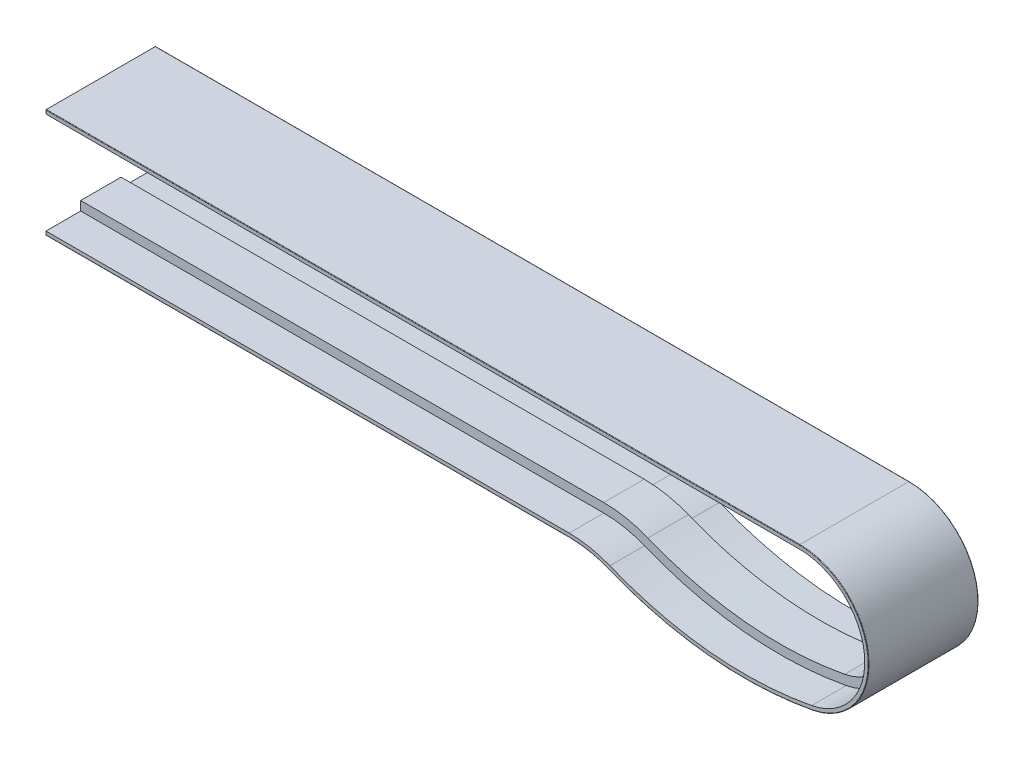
ISO-10303-21;
HEADER;
FILE_DESCRIPTION(('STEP AP214'),'2;1');
FILE_NAME('part.step','',(''),(''),'','','');
FILE_SCHEMA(('AUTOMOTIVE_DESIGN { 1 0 10303 214 1 1 1 1 }'));
ENDSEC;
DATA;
#1=APPLICATION_CONTEXT('core data for automotive mechanical design processes');
#2=APPLICATION_PROTOCOL_DEFINITION('international standard','automotive_design',2000,#1);
#3=PRODUCT_CONTEXT('',#1,'mechanical');
#4=PRODUCT('Part','Part','',(#3));
#5=PRODUCT_RELATED_PRODUCT_CATEGORY('part','',(#4));
#6=PRODUCT_DEFINITION_FORMATION('','',#4);
#7=PRODUCT_DEFINITION_CONTEXT('part definition',#1,'design');
#8=PRODUCT_DEFINITION('design','',#6,#7);
#9=PRODUCT_DEFINITION_SHAPE('','',#8);
#10=(LENGTH_UNIT() NAMED_UNIT(*) SI_UNIT(.MILLI.,.METRE.));
#11=(NAMED_UNIT(*) PLANE_ANGLE_UNIT() SI_UNIT($,.RADIAN.));
#12=(NAMED_UNIT(*) SI_UNIT($,.STERADIAN.) SOLID_ANGLE_UNIT());
#13=UNCERTAINTY_MEASURE_WITH_UNIT(LENGTH_MEASURE(1.E-05),#10,'distance_accuracy_value','');
#14=(GEOMETRIC_REPRESENTATION_CONTEXT(3) GLOBAL_UNCERTAINTY_ASSIGNED_CONTEXT((#13)) GLOBAL_UNIT_ASSIGNED_CONTEXT((#10,
#11,#12)) REPRESENTATION_CONTEXT('',''));
#15=CARTESIAN_POINT('',(0.,0.,0.));
#16=DIRECTION('',(0.,0.,1.));
#17=DIRECTION('',(1.,0.,0.));
#18=AXIS2_PLACEMENT_3D('',#15,#16,#17);
#19=CARTESIAN_POINT('',(545.,-113.,-56.65));
#20=DIRECTION('',(-1.,0.,0.));
#21=DIRECTION('',(0.,-1.,0.));
#22=AXIS2_PLACEMENT_3D('',#19,#20,#21);
#23=CYLINDRICAL_SURFACE('',#22,0.5);
#24=CARTESIAN_POINT('',(545.,-113.,-56.65));
#25=DIRECTION('',(-1.,0.,0.));
#26=DIRECTION('',(0.,0.,-1.));
#27=AXIS2_PLACEMENT_3D('',#24,#25,#26);
#28=CIRCLE('',#27,0.5);
#29=CARTESIAN_POINT('',(545.,-113.,-57.15));
#30=VERTEX_POINT('',#29);
#31=CARTESIAN_POINT('',(545.,-113.5,-56.65));
#32=VERTEX_POINT('',#31);
#33=EDGE_CURVE('E415',#30,#32,#28,.T.);
#34=ORIENTED_EDGE('',*,*,#33,.T.);
#35=DIRECTION('',(-1.,0.,0.));
#36=VECTOR('',#35,1.);
#37=CARTESIAN_POINT('',(545.,-113.5,-56.65));
#38=LINE('',#37,#36);
#39=CARTESIAN_POINT('',(-1.11022302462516E-13,-113.5,-56.65));
#40=VERTEX_POINT('',#39);
#41=EDGE_CURVE('E522',#32,#40,#38,.T.);
#42=ORIENTED_EDGE('',*,*,#41,.T.);
#43=CARTESIAN_POINT('',(0.,-113.,-56.65));
#44=DIRECTION('',(-1.,0.,0.));
#45=DIRECTION('',(0.,0.,-1.));
#46=AXIS2_PLACEMENT_3D('',#43,#44,#45);
#47=CIRCLE('',#46,0.5);
#48=CARTESIAN_POINT('',(0.,-113.,-57.15));
#49=VERTEX_POINT('',#48);
#50=EDGE_CURVE('E64',#49,#40,#47,.T.);
#51=ORIENTED_EDGE('',*,*,#50,.F.);
#52=DIRECTION('',(-1.,0.,0.));
#53=VECTOR('',#52,1.);
#54=CARTESIAN_POINT('',(545.,-113.,-57.15));
#55=LINE('',#54,#53);
#56=EDGE_CURVE('E49',#30,#49,#55,.T.);
#57=ORIENTED_EDGE('',*,*,#56,.F.);
#58=EDGE_LOOP('',(#34,#42,#51,#57));
#59=FACE_BOUND('',#58,.T.);
#60=ADVANCED_FACE('F41',(#59),#23,.T.);
#61=CARTESIAN_POINT('',(545.,-113.5,56.65));
#62=DIRECTION('',(0.,-1.,0.));
#63=DIRECTION('',(1.,0.,0.));
#64=AXIS2_PLACEMENT_3D('',#61,#62,#63);
#65=PLANE('',#64);
#66=DIRECTION('',(0.,0.,1.));
#67=VECTOR('',#66,1.);
#68=CARTESIAN_POINT('',(545.,-113.5,56.65));
#69=LINE('',#68,#67);
#70=CARTESIAN_POINT('',(545.,-113.5,56.65));
#71=VERTEX_POINT('',#70);
#72=EDGE_CURVE('E411',#32,#71,#69,.T.);
#73=ORIENTED_EDGE('',*,*,#72,.T.);
#74=DIRECTION('',(-1.,0.,0.));
#75=VECTOR('',#74,1.);
#76=CARTESIAN_POINT('',(545.,-113.5,56.65));
#77=LINE('',#76,#75);
#78=CARTESIAN_POINT('',(-1.11022302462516E-13,-113.5,56.65));
#79=VERTEX_POINT('',#78);
#80=EDGE_CURVE('E518',#71,#79,#77,.T.);
#81=ORIENTED_EDGE('',*,*,#80,.T.);
#82=DIRECTION('',(0.,0.,1.));
#83=VECTOR('',#82,1.);
#84=CARTESIAN_POINT('',(-1.11022302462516E-13,-113.5,56.65));
#85=LINE('',#84,#83);
#86=EDGE_CURVE('E486',#40,#79,#85,.T.);
#87=ORIENTED_EDGE('',*,*,#86,.F.);
#88=ORIENTED_EDGE('',*,*,#41,.F.);
#89=EDGE_LOOP('',(#73,#81,#87,#88));
#90=FACE_BOUND('',#89,.T.);
#91=ADVANCED_FACE('F537',(#90),#65,.T.);
#92=CARTESIAN_POINT('',(545.,-113.,56.65));
#93=DIRECTION('',(-1.,0.,0.));
#94=DIRECTION('',(0.,-1.,0.));
#95=AXIS2_PLACEMENT_3D('',#92,#93,#94);
#96=CYLINDRICAL_SURFACE('',#95,0.5);
#97=CARTESIAN_POINT('',(545.,-113.,56.65));
#98=DIRECTION('',(-1.,0.,0.));
#99=DIRECTION('',(0.,0.,-1.));
#100=AXIS2_PLACEMENT_3D('',#97,#98,#99);
#101=CIRCLE('',#100,0.5);
#102=CARTESIAN_POINT('',(545.,-113.,57.15));
#103=VERTEX_POINT('',#102);
#104=EDGE_CURVE('E407',#71,#103,#101,.T.);
#105=ORIENTED_EDGE('',*,*,#104,.T.);
#106=DIRECTION('',(-1.,0.,0.));
#107=VECTOR('',#106,1.);
#108=CARTESIAN_POINT('',(545.,-113.,57.15));
#109=LINE('',#108,#107);
#110=CARTESIAN_POINT('',(0.,-113.,57.15));
#111=VERTEX_POINT('',#110);
#112=EDGE_CURVE('E514',#103,#111,#109,.T.);
#113=ORIENTED_EDGE('',*,*,#112,.T.);
#114=CARTESIAN_POINT('',(0.,-113.,56.65));
#115=DIRECTION('',(-1.,0.,0.));
#116=DIRECTION('',(0.,0.,-1.));
#117=AXIS2_PLACEMENT_3D('',#114,#115,#116);
#118=CIRCLE('',#117,0.5);
#119=EDGE_CURVE('E482',#79,#111,#118,.T.);
#120=ORIENTED_EDGE('',*,*,#119,.F.);
#121=ORIENTED_EDGE('',*,*,#80,.F.);
#122=EDGE_LOOP('',(#105,#113,#120,#121));
#123=FACE_BOUND('',#122,.T.);
#124=ADVANCED_FACE('F541',(#123),#96,.T.);
#125=CARTESIAN_POINT('',(545.,-109.5,57.15));
#126=DIRECTION('',(0.,1.,0.));
#127=DIRECTION('',(-1.,0.,0.));
#128=AXIS2_PLACEMENT_3D('',#125,#126,#127);
#129=PLANE('',#128);
#130=DIRECTION('',(0.,0.,-1.));
#131=VECTOR('',#130,1.);
#132=CARTESIAN_POINT('',(545.,-109.5,57.15));
#133=LINE('',#132,#131);
#134=CARTESIAN_POINT('',(545.,-109.5,57.15));
#135=VERTEX_POINT('',#134);
#136=CARTESIAN_POINT('',(545.,-109.5,21.05));
#137=VERTEX_POINT('',#136);
#138=EDGE_CURVE('E403',#135,#137,#133,.T.);
#139=ORIENTED_EDGE('',*,*,#138,.T.);
#140=DIRECTION('',(-1.,0.,0.));
#141=VECTOR('',#140,1.);
#142=CARTESIAN_POINT('',(545.,-109.5,21.05));
#143=LINE('',#142,#141);
#144=CARTESIAN_POINT('',(0.,-109.5,21.05));
#145=VERTEX_POINT('',#144);
#146=EDGE_CURVE('E506',#137,#145,#143,.T.);
#147=ORIENTED_EDGE('',*,*,#146,.T.);
#148=DIRECTION('',(0.,0.,-1.));
#149=VECTOR('',#148,1.);
#150=CARTESIAN_POINT('',(0.,-109.5,57.15));
#151=LINE('',#150,#149);
#152=CARTESIAN_POINT('',(0.,-109.5,57.15));
#153=VERTEX_POINT('',#152);
#154=EDGE_CURVE('E474',#153,#145,#151,.T.);
#155=ORIENTED_EDGE('',*,*,#154,.F.);
#156=DIRECTION('',(-1.,0.,0.));
#157=VECTOR('',#156,1.);
#158=CARTESIAN_POINT('',(545.,-109.5,57.15));
#159=LINE('',#158,#157);
#160=EDGE_CURVE('E510',#135,#153,#159,.T.);
#161=ORIENTED_EDGE('',*,*,#160,.F.);
#162=EDGE_LOOP('',(#139,#147,#155,#161));
#163=FACE_BOUND('',#162,.T.);
#164=ADVANCED_FACE('F664',(#163),#129,.T.);
#165=CARTESIAN_POINT('',(545.,-100.,21.05));
#166=DIRECTION('',(0.,1.,0.));
#167=DIRECTION('',(0.,0.,1.));
#168=AXIS2_PLACEMENT_3D('',#165,#166,#167);
#169=PLANE('',#168);
#170=DIRECTION('',(0.,0.,-1.));
#171=VECTOR('',#170,1.);
#172=CARTESIAN_POINT('',(545.,-100.,21.05));
#173=LINE('',#172,#171);
#174=CARTESIAN_POINT('',(545.,-100.,21.05));
#175=VERTEX_POINT('',#174);
#176=CARTESIAN_POINT('',(545.,-100.,-21.05));
#177=VERTEX_POINT('',#176);
#178=EDGE_CURVE('E399',#175,#177,#173,.T.);
#179=ORIENTED_EDGE('',*,*,#178,.T.);
#180=DIRECTION('',(-1.,0.,0.));
#181=VECTOR('',#180,1.);
#182=CARTESIAN_POINT('',(545.,-100.,-21.05));
#183=LINE('',#182,#181);
#184=CARTESIAN_POINT('',(-1.11022302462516E-13,-100.,-21.05));
#185=VERTEX_POINT('',#184);
#186=EDGE_CURVE('E498',#177,#185,#183,.T.);
#187=ORIENTED_EDGE('',*,*,#186,.T.);
#188=DIRECTION('',(0.,0.,-1.));
#189=VECTOR('',#188,1.);
#190=CARTESIAN_POINT('',(-1.11022302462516E-13,-100.,21.05));
#191=LINE('',#190,#189);
#192=CARTESIAN_POINT('',(-1.11022302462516E-13,-100.,21.05));
#193=VERTEX_POINT('',#192);
#194=EDGE_CURVE('E466',#193,#185,#191,.T.);
#195=ORIENTED_EDGE('',*,*,#194,.F.);
#196=DIRECTION('',(-1.,0.,0.));
#197=VECTOR('',#196,1.);
#198=CARTESIAN_POINT('',(545.,-100.,21.05));
#199=LINE('',#198,#197);
#200=EDGE_CURVE('E502',#175,#193,#199,.T.);
#201=ORIENTED_EDGE('',*,*,#200,.F.);
#202=EDGE_LOOP('',(#179,#187,#195,#201));
#203=FACE_BOUND('',#202,.T.);
#204=ADVANCED_FACE('F669',(#203),#169,.T.);
#205=CARTESIAN_POINT('',(545.,-109.5,-21.05));
#206=DIRECTION('',(0.,1.,0.));
#207=DIRECTION('',(0.,0.,1.));
#208=AXIS2_PLACEMENT_3D('',#205,#206,#207);
#209=PLANE('',#208);
#210=DIRECTION('',(0.,0.,-1.));
#211=VECTOR('',#210,1.);
#212=CARTESIAN_POINT('',(545.,-109.5,-21.05));
#213=LINE('',#212,#211);
#214=CARTESIAN_POINT('',(545.,-109.5,-21.05));
#215=VERTEX_POINT('',#214);
#216=CARTESIAN_POINT('',(545.,-109.5,-57.15));
#217=VERTEX_POINT('',#216);
#218=EDGE_CURVE('E395',#215,#217,#213,.T.);
#219=ORIENTED_EDGE('',*,*,#218,.T.);
#220=DIRECTION('',(-1.,0.,0.));
#221=VECTOR('',#220,1.);
#222=CARTESIAN_POINT('',(545.,-109.5,-57.15));
#223=LINE('',#222,#221);
#224=CARTESIAN_POINT('',(0.,-109.5,-57.15));
#225=VERTEX_POINT('',#224);
#226=EDGE_CURVE('E11',#217,#225,#223,.T.);
#227=ORIENTED_EDGE('',*,*,#226,.T.);
#228=DIRECTION('',(0.,0.,-1.));
#229=VECTOR('',#228,1.);
#230=CARTESIAN_POINT('',(0.,-109.5,-21.05));
#231=LINE('',#230,#229);
#232=CARTESIAN_POINT('',(0.,-109.5,-21.05));
#233=VERTEX_POINT('',#232);
#234=EDGE_CURVE('E459',#233,#225,#231,.T.);
#235=ORIENTED_EDGE('',*,*,#234,.F.);
#236=DIRECTION('',(-1.,0.,0.));
#237=VECTOR('',#236,1.);
#238=CARTESIAN_POINT('',(545.,-109.5,-21.05));
#239=LINE('',#238,#237);
#240=EDGE_CURVE('E494',#215,#233,#239,.T.);
#241=ORIENTED_EDGE('',*,*,#240,.F.);
#242=EDGE_LOOP('',(#219,#227,#235,#241));
#243=FACE_BOUND('',#242,.T.);
#244=ADVANCED_FACE('F545',(#243),#209,.T.);
#245=CARTESIAN_POINT('',(545.,-222.,-56.65));
#246=DIRECTION('',(0.,0.,1.));
#247=DIRECTION('',(1.,0.,0.));
#248=AXIS2_PLACEMENT_3D('',#245,#246,#247);
#249=TOROIDAL_SURFACE('',#248,109.,0.5);
#250=CARTESIAN_POINT('',(586.08854839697,-121.040942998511,-56.65));
#251=DIRECTION('',(-0.926229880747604,0.376959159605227,0.));
#252=DIRECTION('',(0.,0.,-1.));
#253=AXIS2_PLACEMENT_3D('',#250,#251,#252);
#254=CIRCLE('',#253,0.5);
#255=CARTESIAN_POINT('',(586.08854839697,-121.040942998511,-57.15));
#256=VERTEX_POINT('',#255);
#257=CARTESIAN_POINT('',(585.900068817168,-121.504057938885,-56.65));
#258=VERTEX_POINT('',#257);
#259=EDGE_CURVE('E353',#256,#258,#254,.T.);
#260=ORIENTED_EDGE('',*,*,#259,.T.);
#261=CARTESIAN_POINT('',(545.,-222.,-56.65));
#262=DIRECTION('',(0.,0.,1.));
#263=DIRECTION('',(1.,0.,0.));
#264=AXIS2_PLACEMENT_3D('',#261,#262,#263);
#265=CIRCLE('',#264,108.5);
#266=EDGE_CURVE('E447',#258,#32,#265,.T.);
#267=ORIENTED_EDGE('',*,*,#266,.T.);
#268=ORIENTED_EDGE('',*,*,#33,.F.);
#269=CARTESIAN_POINT('',(545.,-222.,-57.15));
#270=DIRECTION('',(0.,0.,1.));
#271=DIRECTION('',(1.,0.,0.));
#272=AXIS2_PLACEMENT_3D('',#269,#270,#271);
#273=CIRCLE('',#272,109.);
#274=EDGE_CURVE('E451',#256,#30,#273,.T.);
#275=ORIENTED_EDGE('',*,*,#274,.F.);
#276=EDGE_LOOP('',(#260,#267,#268,#275));
#277=FACE_BOUND('',#276,.T.);
#278=ADVANCED_FACE('F529',(#277),#249,.T.);
#279=CARTESIAN_POINT('',(545.,-222.,0.));
#280=DIRECTION('',(0.,0.,1.));
#281=DIRECTION('',(1.,0.,0.));
#282=AXIS2_PLACEMENT_3D('',#279,#280,#281);
#283=CYLINDRICAL_SURFACE('',#282,108.5);
#284=DIRECTION('',(0.,0.,1.));
#285=VECTOR('',#284,1.);
#286=CARTESIAN_POINT('',(585.900068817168,-121.504057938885,56.65));
#287=LINE('',#286,#285);
#288=CARTESIAN_POINT('',(585.900068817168,-121.504057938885,56.65));
#289=VERTEX_POINT('',#288);
#290=EDGE_CURVE('E349',#258,#289,#287,.T.);
#291=ORIENTED_EDGE('',*,*,#290,.T.);
#292=CARTESIAN_POINT('',(545.,-222.,56.65));
#293=DIRECTION('',(0.,0.,1.));
#294=DIRECTION('',(1.,0.,0.));
#295=AXIS2_PLACEMENT_3D('',#292,#293,#294);
#296=CIRCLE('',#295,108.5);
#297=EDGE_CURVE('E443',#289,#71,#296,.T.);
#298=ORIENTED_EDGE('',*,*,#297,.T.);
#299=ORIENTED_EDGE('',*,*,#72,.F.);
#300=ORIENTED_EDGE('',*,*,#266,.F.);
#301=EDGE_LOOP('',(#291,#298,#299,#300));
#302=FACE_BOUND('',#301,.T.);
#303=ADVANCED_FACE('F533',(#302),#283,.F.);
#304=CARTESIAN_POINT('',(545.,-222.,56.65));
#305=DIRECTION('',(0.,0.,1.));
#306=DIRECTION('',(1.,0.,0.));
#307=AXIS2_PLACEMENT_3D('',#304,#305,#306);
#308=TOROIDAL_SURFACE('',#307,109.,0.5);
#309=CARTESIAN_POINT('',(586.08854839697,-121.040942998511,56.65));
#310=DIRECTION('',(-0.926229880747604,0.376959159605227,0.));
#311=DIRECTION('',(0.,0.,-1.));
#312=AXIS2_PLACEMENT_3D('',#309,#310,#311);
#313=CIRCLE('',#312,0.5);
#314=CARTESIAN_POINT('',(586.08854839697,-121.040942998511,57.15));
#315=VERTEX_POINT('',#314);
#316=EDGE_CURVE('E345',#289,#315,#313,.T.);
#317=ORIENTED_EDGE('',*,*,#316,.T.);
#318=CARTESIAN_POINT('',(545.,-222.,57.15));
#319=DIRECTION('',(0.,0.,1.));
#320=DIRECTION('',(1.,0.,0.));
#321=AXIS2_PLACEMENT_3D('',#318,#319,#320);
#322=CIRCLE('',#321,109.);
#323=EDGE_CURVE('E439',#315,#103,#322,.T.);
#324=ORIENTED_EDGE('',*,*,#323,.T.);
#325=ORIENTED_EDGE('',*,*,#104,.F.);
#326=ORIENTED_EDGE('',*,*,#297,.F.);
#327=EDGE_LOOP('',(#317,#324,#325,#326));
#328=FACE_BOUND('',#327,.T.);
#329=ADVANCED_FACE('F539',(#328),#308,.T.);
#330=CARTESIAN_POINT('',(545.,-222.,0.));
#331=DIRECTION('',(0.,0.,1.));
#332=DIRECTION('',(1.,0.,0.));
#333=AXIS2_PLACEMENT_3D('',#330,#331,#332);
#334=CYLINDRICAL_SURFACE('',#333,112.5);
#335=DIRECTION('',(0.,0.,-1.));
#336=VECTOR('',#335,1.);
#337=CARTESIAN_POINT('',(587.407905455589,-117.799138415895,57.15));
#338=LINE('',#337,#336);
#339=CARTESIAN_POINT('',(587.407905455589,-117.799138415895,57.15));
#340=VERTEX_POINT('',#339);
#341=CARTESIAN_POINT('',(587.407905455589,-117.799138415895,21.05));
#342=VERTEX_POINT('',#341);
#343=EDGE_CURVE('E341',#340,#342,#338,.T.);
#344=ORIENTED_EDGE('',*,*,#343,.T.);
#345=CARTESIAN_POINT('',(545.,-222.,21.05));
#346=DIRECTION('',(0.,0.,1.));
#347=DIRECTION('',(1.,0.,0.));
#348=AXIS2_PLACEMENT_3D('',#345,#346,#347);
#349=CIRCLE('',#348,112.5);
#350=EDGE_CURVE('E431',#342,#137,#349,.T.);
#351=ORIENTED_EDGE('',*,*,#350,.T.);
#352=ORIENTED_EDGE('',*,*,#138,.F.);
#353=CARTESIAN_POINT('',(545.,-222.,57.15));
#354=DIRECTION('',(0.,0.,1.));
#355=DIRECTION('',(1.,0.,0.));
#356=AXIS2_PLACEMENT_3D('',#353,#354,#355);
#357=CIRCLE('',#356,112.5);
#358=EDGE_CURVE('E435',#340,#135,#357,.T.);
#359=ORIENTED_EDGE('',*,*,#358,.F.);
#360=EDGE_LOOP('',(#344,#351,#352,#359));
#361=FACE_BOUND('',#360,.T.);
#362=ADVANCED_FACE('F682',(#361),#334,.T.);
#363=CARTESIAN_POINT('',(545.,-222.,0.));
#364=DIRECTION('',(0.,0.,1.));
#365=DIRECTION('',(1.,0.,0.));
#366=AXIS2_PLACEMENT_3D('',#363,#364,#365);
#367=CYLINDRICAL_SURFACE('',#366,122.);
#368=DIRECTION('',(0.,0.,-1.));
#369=VECTOR('',#368,1.);
#370=CARTESIAN_POINT('',(590.989017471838,-108.999954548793,21.05));
#371=LINE('',#370,#369);
#372=CARTESIAN_POINT('',(590.989017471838,-108.999954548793,21.05));
#373=VERTEX_POINT('',#372);
#374=CARTESIAN_POINT('',(590.989017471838,-108.999954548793,-21.05));
#375=VERTEX_POINT('',#374);
#376=EDGE_CURVE('E337',#373,#375,#371,.T.);
#377=ORIENTED_EDGE('',*,*,#376,.T.);
#378=CARTESIAN_POINT('',(545.,-222.,-21.05));
#379=DIRECTION('',(0.,0.,1.));
#380=DIRECTION('',(1.,0.,0.));
#381=AXIS2_PLACEMENT_3D('',#378,#379,#380);
#382=CIRCLE('',#381,122.);
#383=EDGE_CURVE('E423',#375,#177,#382,.T.);
#384=ORIENTED_EDGE('',*,*,#383,.T.);
#385=ORIENTED_EDGE('',*,*,#178,.F.);
#386=CARTESIAN_POINT('',(545.,-222.,21.05));
#387=DIRECTION('',(0.,0.,1.));
#388=DIRECTION('',(1.,0.,0.));
#389=AXIS2_PLACEMENT_3D('',#386,#387,#388);
#390=CIRCLE('',#389,122.);
#391=EDGE_CURVE('E427',#373,#175,#390,.T.);
#392=ORIENTED_EDGE('',*,*,#391,.F.);
#393=EDGE_LOOP('',(#377,#384,#385,#392));
#394=FACE_BOUND('',#393,.T.);
#395=ADVANCED_FACE('F685',(#394),#367,.T.);
#396=CARTESIAN_POINT('',(545.,-222.,0.));
#397=DIRECTION('',(0.,0.,1.));
#398=DIRECTION('',(1.,0.,0.));
#399=AXIS2_PLACEMENT_3D('',#396,#397,#398);
#400=CYLINDRICAL_SURFACE('',#399,112.5);
#401=DIRECTION('',(0.,0.,-1.));
#402=VECTOR('',#401,1.);
#403=CARTESIAN_POINT('',(587.407905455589,-117.799138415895,-21.05));
#404=LINE('',#403,#402);
#405=CARTESIAN_POINT('',(587.407905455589,-117.799138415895,-21.05));
#406=VERTEX_POINT('',#405);
#407=CARTESIAN_POINT('',(587.407905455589,-117.799138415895,-57.15));
#408=VERTEX_POINT('',#407);
#409=EDGE_CURVE('E250',#406,#408,#404,.T.);
#410=ORIENTED_EDGE('',*,*,#409,.T.);
#411=CARTESIAN_POINT('',(545.,-222.,-57.15));
#412=DIRECTION('',(0.,0.,1.));
#413=DIRECTION('',(1.,0.,0.));
#414=AXIS2_PLACEMENT_3D('',#411,#412,#413);
#415=CIRCLE('',#414,112.5);
#416=EDGE_CURVE('E455',#408,#217,#415,.T.);
#417=ORIENTED_EDGE('',*,*,#416,.T.);
#418=ORIENTED_EDGE('',*,*,#218,.F.);
#419=CARTESIAN_POINT('',(545.,-222.,-21.05));
#420=DIRECTION('',(0.,0.,1.));
#421=DIRECTION('',(1.,0.,0.));
#422=AXIS2_PLACEMENT_3D('',#419,#420,#421);
#423=CIRCLE('',#422,112.5);
#424=EDGE_CURVE('E419',#406,#215,#423,.T.);
#425=ORIENTED_EDGE('',*,*,#424,.F.);
#426=EDGE_LOOP('',(#410,#417,#418,#425));
#427=FACE_BOUND('',#426,.T.);
#428=ADVANCED_FACE('F549',(#427),#400,.T.);
#429=CARTESIAN_POINT('',(728.142031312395,228.,-56.65));
#430=DIRECTION('',(0.,0.,-1.));
#431=DIRECTION('',(-1.,0.,0.));
#432=AXIS2_PLACEMENT_3D('',#429,#430,#431);
#433=TOROIDAL_SURFACE('',#432,376.840512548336,0.5);
#434=CARTESIAN_POINT('',(798.314134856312,-142.249439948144,-56.65));
#435=DIRECTION('',(-0.982509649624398,-0.186211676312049,0.));
#436=DIRECTION('',(0.,0.,-1.));
#437=AXIS2_PLACEMENT_3D('',#434,#435,#436);
#438=CIRCLE('',#437,0.5);
#439=CARTESIAN_POINT('',(798.314134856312,-142.249439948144,-57.15));
#440=VERTEX_POINT('',#439);
#441=CARTESIAN_POINT('',(798.407240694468,-142.740694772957,-56.65));
#442=VERTEX_POINT('',#441);
#443=EDGE_CURVE('E298',#440,#442,#438,.T.);
#444=ORIENTED_EDGE('',*,*,#443,.T.);
#445=CARTESIAN_POINT('',(728.142031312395,228.,-56.65));
#446=DIRECTION('',(0.,0.,-1.));
#447=DIRECTION('',(-1.,0.,0.));
#448=AXIS2_PLACEMENT_3D('',#445,#446,#447);
#449=CIRCLE('',#448,377.340512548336);
#450=EDGE_CURVE('E385',#442,#258,#449,.T.);
#451=ORIENTED_EDGE('',*,*,#450,.T.);
#452=ORIENTED_EDGE('',*,*,#259,.F.);
#453=CARTESIAN_POINT('',(728.142031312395,228.,-57.15));
#454=DIRECTION('',(0.,0.,-1.));
#455=DIRECTION('',(-1.,0.,0.));
#456=AXIS2_PLACEMENT_3D('',#453,#454,#455);
#457=CIRCLE('',#456,376.840512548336);
#458=EDGE_CURVE('E389',#440,#256,#457,.T.);
#459=ORIENTED_EDGE('',*,*,#458,.F.);
#460=EDGE_LOOP('',(#444,#451,#452,#459));
#461=FACE_BOUND('',#460,.T.);
#462=ADVANCED_FACE('F692',(#461),#433,.T.);
#463=CARTESIAN_POINT('',(728.142031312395,228.,0.));
#464=DIRECTION('',(0.,0.,-1.));
#465=DIRECTION('',(-1.,0.,0.));
#466=AXIS2_PLACEMENT_3D('',#463,#464,#465);
#467=CYLINDRICAL_SURFACE('',#466,377.340512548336);
#468=DIRECTION('',(0.,0.,1.));
#469=VECTOR('',#468,1.);
#470=CARTESIAN_POINT('',(798.407240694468,-142.740694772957,56.65));
#471=LINE('',#470,#469);
#472=CARTESIAN_POINT('',(798.407240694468,-142.740694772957,56.65));
#473=VERTEX_POINT('',#472);
#474=EDGE_CURVE('E294',#442,#473,#471,.T.);
#475=ORIENTED_EDGE('',*,*,#474,.T.);
#476=CARTESIAN_POINT('',(728.142031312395,228.,56.65));
#477=DIRECTION('',(0.,0.,-1.));
#478=DIRECTION('',(-1.,0.,0.));
#479=AXIS2_PLACEMENT_3D('',#476,#477,#478);
#480=CIRCLE('',#479,377.340512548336);
#481=EDGE_CURVE('E381',#473,#289,#480,.T.);
#482=ORIENTED_EDGE('',*,*,#481,.T.);
#483=ORIENTED_EDGE('',*,*,#290,.F.);
#484=ORIENTED_EDGE('',*,*,#450,.F.);
#485=EDGE_LOOP('',(#475,#482,#483,#484));
#486=FACE_BOUND('',#485,.T.);
#487=ADVANCED_FACE('F695',(#486),#467,.T.);
#488=CARTESIAN_POINT('',(728.142031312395,228.,56.65));
#489=DIRECTION('',(0.,0.,-1.));
#490=DIRECTION('',(-1.,0.,0.));
#491=AXIS2_PLACEMENT_3D('',#488,#489,#490);
#492=TOROIDAL_SURFACE('',#491,376.840512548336,0.5);
#493=CARTESIAN_POINT('',(798.314134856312,-142.249439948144,56.65));
#494=DIRECTION('',(-0.982509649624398,-0.186211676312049,0.));
#495=DIRECTION('',(0.,0.,-1.));
#496=AXIS2_PLACEMENT_3D('',#493,#494,#495);
#497=CIRCLE('',#496,0.5);
#498=CARTESIAN_POINT('',(798.314134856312,-142.249439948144,57.15));
#499=VERTEX_POINT('',#498);
#500=EDGE_CURVE('E290',#473,#499,#497,.T.);
#501=ORIENTED_EDGE('',*,*,#500,.T.);
#502=CARTESIAN_POINT('',(728.142031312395,228.,57.15));
#503=DIRECTION('',(0.,0.,-1.));
#504=DIRECTION('',(-1.,0.,0.));
#505=AXIS2_PLACEMENT_3D('',#502,#503,#504);
#506=CIRCLE('',#505,376.840512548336);
#507=EDGE_CURVE('E377',#499,#315,#506,.T.);
#508=ORIENTED_EDGE('',*,*,#507,.T.);
#509=ORIENTED_EDGE('',*,*,#316,.F.);
#510=ORIENTED_EDGE('',*,*,#481,.F.);
#511=EDGE_LOOP('',(#501,#508,#509,#510));
#512=FACE_BOUND('',#511,.T.);
#513=ADVANCED_FACE('F699',(#512),#492,.T.);
#514=CARTESIAN_POINT('',(728.142031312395,228.,0.));
#515=DIRECTION('',(0.,0.,-1.));
#516=DIRECTION('',(-1.,0.,0.));
#517=AXIS2_PLACEMENT_3D('',#514,#515,#516);
#518=CYLINDRICAL_SURFACE('',#517,373.340512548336);
#519=DIRECTION('',(0.,0.,-1.));
#520=VECTOR('',#519,1.);
#521=CARTESIAN_POINT('',(797.662393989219,-138.810656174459,57.15));
#522=LINE('',#521,#520);
#523=CARTESIAN_POINT('',(797.662393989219,-138.810656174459,57.15));
#524=VERTEX_POINT('',#523);
#525=CARTESIAN_POINT('',(797.662393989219,-138.810656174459,21.05));
#526=VERTEX_POINT('',#525);
#527=EDGE_CURVE('E286',#524,#526,#522,.T.);
#528=ORIENTED_EDGE('',*,*,#527,.T.);
#529=CARTESIAN_POINT('',(728.142031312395,228.,21.05));
#530=DIRECTION('',(0.,0.,-1.));
#531=DIRECTION('',(-1.,0.,0.));
#532=AXIS2_PLACEMENT_3D('',#529,#530,#531);
#533=CIRCLE('',#532,373.340512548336);
#534=EDGE_CURVE('E369',#526,#342,#533,.T.);
#535=ORIENTED_EDGE('',*,*,#534,.T.);
#536=ORIENTED_EDGE('',*,*,#343,.F.);
#537=CARTESIAN_POINT('',(728.142031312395,228.,57.15));
#538=DIRECTION('',(0.,0.,-1.));
#539=DIRECTION('',(-1.,0.,0.));
#540=AXIS2_PLACEMENT_3D('',#537,#538,#539);
#541=CIRCLE('',#540,373.340512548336);
#542=EDGE_CURVE('E373',#524,#340,#541,.T.);
#543=ORIENTED_EDGE('',*,*,#542,.F.);
#544=EDGE_LOOP('',(#528,#535,#536,#543));
#545=FACE_BOUND('',#544,.T.);
#546=ADVANCED_FACE('F703',(#545),#518,.F.);
#547=CARTESIAN_POINT('',(728.142031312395,228.,0.));
#548=DIRECTION('',(0.,0.,-1.));
#549=DIRECTION('',(-1.,0.,0.));
#550=AXIS2_PLACEMENT_3D('',#547,#548,#549);
#551=CYLINDRICAL_SURFACE('',#550,363.840512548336);
#552=DIRECTION('',(0.,0.,-1.));
#553=VECTOR('',#552,1.);
#554=CARTESIAN_POINT('',(795.893383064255,-129.476814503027,21.05));
#555=LINE('',#554,#553);
#556=CARTESIAN_POINT('',(795.893383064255,-129.476814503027,21.05));
#557=VERTEX_POINT('',#556);
#558=CARTESIAN_POINT('',(795.893383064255,-129.476814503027,-21.05));
#559=VERTEX_POINT('',#558);
#560=EDGE_CURVE('E275',#557,#559,#555,.T.);
#561=ORIENTED_EDGE('',*,*,#560,.T.);
#562=CARTESIAN_POINT('',(728.142031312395,228.,-21.05));
#563=DIRECTION('',(0.,0.,-1.));
#564=DIRECTION('',(-1.,0.,0.));
#565=AXIS2_PLACEMENT_3D('',#562,#563,#564);
#566=CIRCLE('',#565,363.840512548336);
#567=EDGE_CURVE('E361',#559,#375,#566,.T.);
#568=ORIENTED_EDGE('',*,*,#567,.T.);
#569=ORIENTED_EDGE('',*,*,#376,.F.);
#570=CARTESIAN_POINT('',(728.142031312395,228.,21.05));
#571=DIRECTION('',(0.,0.,-1.));
#572=DIRECTION('',(-1.,0.,0.));
#573=AXIS2_PLACEMENT_3D('',#570,#571,#572);
#574=CIRCLE('',#573,363.840512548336);
#575=EDGE_CURVE('E365',#557,#373,#574,.T.);
#576=ORIENTED_EDGE('',*,*,#575,.F.);
#577=EDGE_LOOP('',(#561,#568,#569,#576));
#578=FACE_BOUND('',#577,.T.);
#579=ADVANCED_FACE('F707',(#578),#551,.F.);
#580=CARTESIAN_POINT('',(728.142031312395,228.,0.));
#581=DIRECTION('',(0.,0.,-1.));
#582=DIRECTION('',(-1.,0.,0.));
#583=AXIS2_PLACEMENT_3D('',#580,#581,#582);
#584=CYLINDRICAL_SURFACE('',#583,373.340512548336);
#585=DIRECTION('',(0.,0.,-1.));
#586=VECTOR('',#585,1.);
#587=CARTESIAN_POINT('',(797.662393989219,-138.810656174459,-21.05));
#588=LINE('',#587,#586);
#589=CARTESIAN_POINT('',(797.662393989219,-138.810656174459,-21.05));
#590=VERTEX_POINT('',#589);
#591=CARTESIAN_POINT('',(797.662393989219,-138.810656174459,-57.15));
#592=VERTEX_POINT('',#591);
#593=EDGE_CURVE('E269',#590,#592,#588,.T.);
#594=ORIENTED_EDGE('',*,*,#593,.T.);
#595=CARTESIAN_POINT('',(728.142031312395,228.,-57.15));
#596=DIRECTION('',(0.,0.,-1.));
#597=DIRECTION('',(-1.,0.,0.));
#598=AXIS2_PLACEMENT_3D('',#595,#596,#597);
#599=CIRCLE('',#598,373.340512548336);
#600=EDGE_CURVE('E245',#592,#408,#599,.T.);
#601=ORIENTED_EDGE('',*,*,#600,.T.);
#602=ORIENTED_EDGE('',*,*,#409,.F.);
#603=CARTESIAN_POINT('',(728.142031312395,228.,-21.05));
#604=DIRECTION('',(0.,0.,-1.));
#605=DIRECTION('',(-1.,0.,0.));
#606=AXIS2_PLACEMENT_3D('',#603,#604,#605);
#607=CIRCLE('',#606,373.340512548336);
#608=EDGE_CURVE('E357',#590,#406,#607,.T.);
#609=ORIENTED_EDGE('',*,*,#608,.F.);
#610=EDGE_LOOP('',(#594,#601,#602,#609));
#611=FACE_BOUND('',#610,.T.);
#612=ADVANCED_FACE('F551',(#611),#584,.F.);
#613=CARTESIAN_POINT('',(785.,-72.,-56.65));
#614=DIRECTION('',(0.,0.,-1.));
#615=DIRECTION('',(-1.,0.,0.));
#616=AXIS2_PLACEMENT_3D('',#613,#614,#615);
#617=TOROIDAL_SURFACE('',#616,71.5,0.5);
#618=CARTESIAN_POINT('',(785.,-0.5,-56.65));
#619=DIRECTION('',(1.,0.,0.));
#620=DIRECTION('',(0.,0.,-1.));
#621=AXIS2_PLACEMENT_3D('',#618,#619,#620);
#622=CIRCLE('',#621,0.5);
#623=CARTESIAN_POINT('',(785.,-0.500000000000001,-57.15));
#624=VERTEX_POINT('',#623);
#625=CARTESIAN_POINT('',(785.,0.,-56.65));
#626=VERTEX_POINT('',#625);
#627=EDGE_CURVE('E262',#624,#626,#622,.T.);
#628=ORIENTED_EDGE('',*,*,#627,.T.);
#629=CARTESIAN_POINT('',(785.,-72.,-56.65));
#630=DIRECTION('',(0.,0.,-1.));
#631=DIRECTION('',(-1.,0.,0.));
#632=AXIS2_PLACEMENT_3D('',#629,#630,#631);
#633=CIRCLE('',#632,72.);
#634=EDGE_CURVE('E327',#626,#442,#633,.T.);
#635=ORIENTED_EDGE('',*,*,#634,.T.);
#636=ORIENTED_EDGE('',*,*,#443,.F.);
#637=CARTESIAN_POINT('',(785.,-72.,-57.15));
#638=DIRECTION('',(0.,0.,-1.));
#639=DIRECTION('',(-1.,0.,0.));
#640=AXIS2_PLACEMENT_3D('',#637,#638,#639);
#641=CIRCLE('',#640,71.5);
#642=EDGE_CURVE('E251',#624,#440,#641,.T.);
#643=ORIENTED_EDGE('',*,*,#642,.F.);
#644=EDGE_LOOP('',(#628,#635,#636,#643));
#645=FACE_BOUND('',#644,.T.);
#646=ADVANCED_FACE('F714',(#645),#617,.T.);
#647=CARTESIAN_POINT('',(785.,-72.,0.));
#648=DIRECTION('',(0.,0.,-1.));
#649=DIRECTION('',(-1.,0.,0.));
#650=AXIS2_PLACEMENT_3D('',#647,#648,#649);
#651=CYLINDRICAL_SURFACE('',#650,72.);
#652=DIRECTION('',(0.,0.,1.));
#653=VECTOR('',#652,1.);
#654=CARTESIAN_POINT('',(785.,0.,56.65));
#655=LINE('',#654,#653);
#656=CARTESIAN_POINT('',(785.,0.,56.65));
#657=VERTEX_POINT('',#656);
#658=EDGE_CURVE('E600',#626,#657,#655,.T.);
#659=ORIENTED_EDGE('',*,*,#658,.T.);
#660=CARTESIAN_POINT('',(785.,-72.,56.65));
#661=DIRECTION('',(0.,0.,-1.));
#662=DIRECTION('',(-1.,0.,0.));
#663=AXIS2_PLACEMENT_3D('',#660,#661,#662);
#664=CIRCLE('',#663,72.);
#665=EDGE_CURVE('E323',#657,#473,#664,.T.);
#666=ORIENTED_EDGE('',*,*,#665,.T.);
#667=ORIENTED_EDGE('',*,*,#474,.F.);
#668=ORIENTED_EDGE('',*,*,#634,.F.);
#669=EDGE_LOOP('',(#659,#666,#667,#668));
#670=FACE_BOUND('',#669,.T.);
#671=ADVANCED_FACE('F717',(#670),#651,.T.);
#672=CARTESIAN_POINT('',(785.,-72.,56.65));
#673=DIRECTION('',(0.,0.,-1.));
#674=DIRECTION('',(-1.,0.,0.));
#675=AXIS2_PLACEMENT_3D('',#672,#673,#674);
#676=TOROIDAL_SURFACE('',#675,71.5,0.5);
#677=CARTESIAN_POINT('',(785.,-0.5,56.65));
#678=DIRECTION('',(1.,0.,0.));
#679=DIRECTION('',(0.,0.,-1.));
#680=AXIS2_PLACEMENT_3D('',#677,#678,#679);
#681=CIRCLE('',#680,0.5);
#682=CARTESIAN_POINT('',(785.,-0.499999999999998,57.15));
#683=VERTEX_POINT('',#682);
#684=EDGE_CURVE('E637',#657,#683,#681,.T.);
#685=ORIENTED_EDGE('',*,*,#684,.T.);
#686=CARTESIAN_POINT('',(785.,-72.,57.15));
#687=DIRECTION('',(0.,0.,-1.));
#688=DIRECTION('',(-1.,0.,0.));
#689=AXIS2_PLACEMENT_3D('',#686,#687,#688);
#690=CIRCLE('',#689,71.5);
#691=EDGE_CURVE('E319',#683,#499,#690,.T.);
#692=ORIENTED_EDGE('',*,*,#691,.T.);
#693=ORIENTED_EDGE('',*,*,#500,.F.);
#694=ORIENTED_EDGE('',*,*,#665,.F.);
#695=EDGE_LOOP('',(#685,#692,#693,#694));
#696=FACE_BOUND('',#695,.T.);
#697=ADVANCED_FACE('F720',(#696),#676,.T.);
#698=CARTESIAN_POINT('',(785.,-72.,0.));
#699=DIRECTION('',(0.,0.,-1.));
#700=DIRECTION('',(-1.,0.,0.));
#701=AXIS2_PLACEMENT_3D('',#698,#699,#700);
#702=CYLINDRICAL_SURFACE('',#701,68.);
#703=DIRECTION('',(0.,0.,-1.));
#704=VECTOR('',#703,1.);
#705=CARTESIAN_POINT('',(785.,-4.,57.15));
#706=LINE('',#705,#704);
#707=CARTESIAN_POINT('',(785.,-4.,57.15));
#708=VERTEX_POINT('',#707);
#709=CARTESIAN_POINT('',(785.,-4.,21.05));
#710=VERTEX_POINT('',#709);
#711=EDGE_CURVE('E566',#708,#710,#706,.T.);
#712=ORIENTED_EDGE('',*,*,#711,.T.);
#713=CARTESIAN_POINT('',(785.,-72.,21.05));
#714=DIRECTION('',(0.,0.,-1.));
#715=DIRECTION('',(-1.,0.,0.));
#716=AXIS2_PLACEMENT_3D('',#713,#714,#715);
#717=CIRCLE('',#716,68.);
#718=EDGE_CURVE('E312',#710,#526,#717,.T.);
#719=ORIENTED_EDGE('',*,*,#718,.T.);
#720=ORIENTED_EDGE('',*,*,#527,.F.);
#721=CARTESIAN_POINT('',(785.,-72.,57.15));
#722=DIRECTION('',(0.,0.,-1.));
#723=DIRECTION('',(-1.,0.,0.));
#724=AXIS2_PLACEMENT_3D('',#721,#722,#723);
#725=CIRCLE('',#724,68.);
#726=EDGE_CURVE('E315',#708,#524,#725,.T.);
#727=ORIENTED_EDGE('',*,*,#726,.F.);
#728=EDGE_LOOP('',(#712,#719,#720,#727));
#729=FACE_BOUND('',#728,.T.);
#730=ADVANCED_FACE('F724',(#729),#702,.F.);
#731=CARTESIAN_POINT('',(785.,-72.,0.));
#732=DIRECTION('',(0.,0.,-1.));
#733=DIRECTION('',(-1.,0.,0.));
#734=AXIS2_PLACEMENT_3D('',#731,#732,#733);
#735=CYLINDRICAL_SURFACE('',#734,58.5);
#736=DIRECTION('',(0.,0.,-1.));
#737=VECTOR('',#736,1.);
#738=CARTESIAN_POINT('',(785.,-13.5,21.05));
#739=LINE('',#738,#737);
#740=CARTESIAN_POINT('',(785.,-13.5,21.05));
#741=VERTEX_POINT('',#740);
#742=CARTESIAN_POINT('',(785.,-13.5,-21.05));
#743=VERTEX_POINT('',#742);
#744=EDGE_CURVE('E558',#741,#743,#739,.T.);
#745=ORIENTED_EDGE('',*,*,#744,.T.);
#746=CARTESIAN_POINT('',(785.,-72.,-21.05));
#747=DIRECTION('',(0.,0.,-1.));
#748=DIRECTION('',(-1.,0.,0.));
#749=AXIS2_PLACEMENT_3D('',#746,#747,#748);
#750=CIRCLE('',#749,58.5);
#751=EDGE_CURVE('E304',#743,#559,#750,.T.);
#752=ORIENTED_EDGE('',*,*,#751,.T.);
#753=ORIENTED_EDGE('',*,*,#560,.F.);
#754=CARTESIAN_POINT('',(785.,-72.,21.05));
#755=DIRECTION('',(0.,0.,-1.));
#756=DIRECTION('',(-1.,0.,0.));
#757=AXIS2_PLACEMENT_3D('',#754,#755,#756);
#758=CIRCLE('',#757,58.5);
#759=EDGE_CURVE('E308',#741,#557,#758,.T.);
#760=ORIENTED_EDGE('',*,*,#759,.F.);
#761=EDGE_LOOP('',(#745,#752,#753,#760));
#762=FACE_BOUND('',#761,.T.);
#763=ADVANCED_FACE('F728',(#762),#735,.F.);
#764=CARTESIAN_POINT('',(785.,-72.,0.));
#765=DIRECTION('',(0.,0.,-1.));
#766=DIRECTION('',(-1.,0.,0.));
#767=AXIS2_PLACEMENT_3D('',#764,#765,#766);
#768=CYLINDRICAL_SURFACE('',#767,68.);
#769=DIRECTION('',(0.,0.,-1.));
#770=VECTOR('',#769,1.);
#771=CARTESIAN_POINT('',(785.,-3.99999999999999,-21.05));
#772=LINE('',#771,#770);
#773=CARTESIAN_POINT('',(785.,-3.99999999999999,-21.05));
#774=VERTEX_POINT('',#773);
#775=CARTESIAN_POINT('',(785.,-3.99999999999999,-57.15));
#776=VERTEX_POINT('',#775);
#777=EDGE_CURVE('E254',#774,#776,#772,.T.);
#778=ORIENTED_EDGE('',*,*,#777,.T.);
#779=CARTESIAN_POINT('',(785.,-72.,-57.15));
#780=DIRECTION('',(0.,0.,-1.));
#781=DIRECTION('',(-1.,0.,0.));
#782=AXIS2_PLACEMENT_3D('',#779,#780,#781);
#783=CIRCLE('',#782,68.);
#784=EDGE_CURVE('E238',#776,#592,#783,.T.);
#785=ORIENTED_EDGE('',*,*,#784,.T.);
#786=ORIENTED_EDGE('',*,*,#593,.F.);
#787=CARTESIAN_POINT('',(785.,-72.,-21.05));
#788=DIRECTION('',(0.,0.,-1.));
#789=DIRECTION('',(-1.,0.,0.));
#790=AXIS2_PLACEMENT_3D('',#787,#788,#789);
#791=CIRCLE('',#790,68.);
#792=EDGE_CURVE('E257',#774,#590,#791,.T.);
#793=ORIENTED_EDGE('',*,*,#792,.F.);
#794=EDGE_LOOP('',(#778,#785,#786,#793));
#795=FACE_BOUND('',#794,.T.);
#796=ADVANCED_FACE('F255',(#795),#768,.F.);
#797=CARTESIAN_POINT('',(785.,-3.99999999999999,-21.05));
#798=DIRECTION('',(0.,1.,0.));
#799=DIRECTION('',(0.,0.,1.));
#800=AXIS2_PLACEMENT_3D('',#797,#798,#799);
#801=PLANE('',#800);
#802=DIRECTION('',(0.,0.,-1.));
#803=VECTOR('',#802,1.);
#804=CARTESIAN_POINT('',(0.,-3.99999999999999,-21.05));
#805=LINE('',#804,#803);
#806=CARTESIAN_POINT('',(0.,-3.99999999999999,-21.05));
#807=VERTEX_POINT('',#806);
#808=CARTESIAN_POINT('',(0.,-3.99999999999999,-57.15));
#809=VERTEX_POINT('',#808);
#810=EDGE_CURVE('E267',#807,#809,#805,.T.);
#811=ORIENTED_EDGE('',*,*,#810,.T.);
#812=DIRECTION('',(-1.,0.,0.));
#813=VECTOR('',#812,1.);
#814=CARTESIAN_POINT('',(785.,-3.99999999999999,-57.15));
#815=LINE('',#814,#813);
#816=EDGE_CURVE('E242',#776,#809,#815,.T.);
#817=ORIENTED_EDGE('',*,*,#816,.F.);
#818=ORIENTED_EDGE('',*,*,#777,.F.);
#819=DIRECTION('',(-1.,0.,0.));
#820=VECTOR('',#819,1.);
#821=CARTESIAN_POINT('',(785.,-3.99999999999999,-21.05));
#822=LINE('',#821,#820);
#823=EDGE_CURVE('E554',#774,#807,#822,.T.);
#824=ORIENTED_EDGE('',*,*,#823,.T.);
#825=EDGE_LOOP('',(#811,#817,#818,#824));
#826=FACE_BOUND('',#825,.T.);
#827=ADVANCED_FACE('F265',(#826),#801,.F.);
#828=CARTESIAN_POINT('',(785.,-3.99999999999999,-57.15));
#829=DIRECTION('',(0.,0.,1.));
#830=DIRECTION('',(0.,-1.,0.));
#831=AXIS2_PLACEMENT_3D('',#828,#829,#830);
#832=PLANE('',#831);
#833=DIRECTION('',(0.,1.,0.));
#834=VECTOR('',#833,1.);
#835=CARTESIAN_POINT('',(0.,-3.99999999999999,-57.15));
#836=LINE('',#835,#834);
#837=CARTESIAN_POINT('',(0.,-0.500000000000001,-57.15));
#838=VERTEX_POINT('',#837);
#839=EDGE_CURVE('E616',#809,#838,#836,.T.);
#840=ORIENTED_EDGE('',*,*,#839,.T.);
#841=DIRECTION('',(-1.,0.,0.));
#842=VECTOR('',#841,1.);
#843=CARTESIAN_POINT('',(785.,-0.500000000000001,-57.15));
#844=LINE('',#843,#842);
#845=EDGE_CURVE('E270',#624,#838,#844,.T.);
#846=ORIENTED_EDGE('',*,*,#845,.F.);
#847=ORIENTED_EDGE('',*,*,#642,.T.);
#848=ORIENTED_EDGE('',*,*,#458,.T.);
#849=ORIENTED_EDGE('',*,*,#274,.T.);
#850=ORIENTED_EDGE('',*,*,#56,.T.);
#851=DIRECTION('',(0.,-1.,0.));
#852=VECTOR('',#851,1.);
#853=CARTESIAN_POINT('',(0.,-109.5,-57.15));
#854=LINE('',#853,#852);
#855=EDGE_CURVE('E56',#225,#49,#854,.T.);
#856=ORIENTED_EDGE('',*,*,#855,.F.);
#857=ORIENTED_EDGE('',*,*,#226,.F.);
#858=ORIENTED_EDGE('',*,*,#416,.F.);
#859=ORIENTED_EDGE('',*,*,#600,.F.);
#860=ORIENTED_EDGE('',*,*,#784,.F.);
#861=ORIENTED_EDGE('',*,*,#816,.T.);
#862=EDGE_LOOP('',(#840,#846,#847,#848,#849,#850,#856,#857,#858,#859,#860,#861));
#863=FACE_BOUND('',#862,.T.);
#864=ADVANCED_FACE('F240',(#863),#832,.F.);
#865=CARTESIAN_POINT('',(785.,-0.5,-56.65));
#866=DIRECTION('',(-1.,0.,0.));
#867=DIRECTION('',(0.,0.,1.));
#868=AXIS2_PLACEMENT_3D('',#865,#866,#867);
#869=CYLINDRICAL_SURFACE('',#868,0.5);
#870=CARTESIAN_POINT('',(0.,-0.5,-56.65));
#871=DIRECTION('',(1.,0.,0.));
#872=DIRECTION('',(0.,0.,-1.));
#873=AXIS2_PLACEMENT_3D('',#870,#871,#872);
#874=CIRCLE('',#873,0.5);
#875=CARTESIAN_POINT('',(0.,0.,-56.65));
#876=VERTEX_POINT('',#875);
#877=EDGE_CURVE('E607',#838,#876,#874,.T.);
#878=ORIENTED_EDGE('',*,*,#877,.T.);
#879=DIRECTION('',(-1.,0.,0.));
#880=VECTOR('',#879,1.);
#881=CARTESIAN_POINT('',(785.,0.,-56.65));
#882=LINE('',#881,#880);
#883=EDGE_CURVE('E279',#626,#876,#882,.T.);
#884=ORIENTED_EDGE('',*,*,#883,.F.);
#885=ORIENTED_EDGE('',*,*,#627,.F.);
#886=ORIENTED_EDGE('',*,*,#845,.T.);
#887=EDGE_LOOP('',(#878,#884,#885,#886));
#888=FACE_BOUND('',#887,.T.);
#889=ADVANCED_FACE('F647',(#888),#869,.T.);
#890=CARTESIAN_POINT('',(785.,0.,56.65));
#891=DIRECTION('',(0.,-1.,0.));
#892=DIRECTION('',(0.,0.,-1.));
#893=AXIS2_PLACEMENT_3D('',#890,#891,#892);
#894=PLANE('',#893);
#895=DIRECTION('',(0.,0.,1.));
#896=VECTOR('',#895,1.);
#897=CARTESIAN_POINT('',(0.,0.,56.65));
#898=LINE('',#897,#896);
#899=CARTESIAN_POINT('',(0.,0.,56.65));
#900=VERTEX_POINT('',#899);
#901=EDGE_CURVE('E598',#876,#900,#898,.T.);
#902=ORIENTED_EDGE('',*,*,#901,.T.);
#903=DIRECTION('',(-1.,0.,0.));
#904=VECTOR('',#903,1.);
#905=CARTESIAN_POINT('',(785.,0.,56.65));
#906=LINE('',#905,#904);
#907=EDGE_CURVE('E586',#657,#900,#906,.T.);
#908=ORIENTED_EDGE('',*,*,#907,.F.);
#909=ORIENTED_EDGE('',*,*,#658,.F.);
#910=ORIENTED_EDGE('',*,*,#883,.T.);
#911=EDGE_LOOP('',(#902,#908,#909,#910));
#912=FACE_BOUND('',#911,.T.);
#913=ADVANCED_FACE('F596',(#912),#894,.F.);
#914=CARTESIAN_POINT('',(785.,-0.5,56.65));
#915=DIRECTION('',(-1.,0.,0.));
#916=DIRECTION('',(0.,0.,1.));
#917=AXIS2_PLACEMENT_3D('',#914,#915,#916);
#918=CYLINDRICAL_SURFACE('',#917,0.5);
#919=CARTESIAN_POINT('',(0.,-0.5,56.65));
#920=DIRECTION('',(1.,0.,0.));
#921=DIRECTION('',(0.,0.,-1.));
#922=AXIS2_PLACEMENT_3D('',#919,#920,#921);
#923=CIRCLE('',#922,0.5);
#924=CARTESIAN_POINT('',(0.,-0.499999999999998,57.15));
#925=VERTEX_POINT('',#924);
#926=EDGE_CURVE('E609',#900,#925,#923,.T.);
#927=ORIENTED_EDGE('',*,*,#926,.T.);
#928=DIRECTION('',(-1.,0.,0.));
#929=VECTOR('',#928,1.);
#930=CARTESIAN_POINT('',(785.,-0.499999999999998,57.15));
#931=LINE('',#930,#929);
#932=EDGE_CURVE('E582',#683,#925,#931,.T.);
#933=ORIENTED_EDGE('',*,*,#932,.F.);
#934=ORIENTED_EDGE('',*,*,#684,.F.);
#935=ORIENTED_EDGE('',*,*,#907,.T.);
#936=EDGE_LOOP('',(#927,#933,#934,#935));
#937=FACE_BOUND('',#936,.T.);
#938=ADVANCED_FACE('F654',(#937),#918,.T.);
#939=CARTESIAN_POINT('',(785.,-0.499999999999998,57.15));
#940=DIRECTION('',(0.,0.,-1.));
#941=DIRECTION('',(0.,1.,0.));
#942=AXIS2_PLACEMENT_3D('',#939,#940,#941);
#943=PLANE('',#942);
#944=DIRECTION('',(0.,-1.,0.));
#945=VECTOR('',#944,1.);
#946=CARTESIAN_POINT('',(0.,-0.499999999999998,57.15));
#947=LINE('',#946,#945);
#948=CARTESIAN_POINT('',(0.,-4.,57.15));
#949=VERTEX_POINT('',#948);
#950=EDGE_CURVE('E613',#925,#949,#947,.T.);
#951=ORIENTED_EDGE('',*,*,#950,.T.);
#952=DIRECTION('',(-1.,0.,0.));
#953=VECTOR('',#952,1.);
#954=CARTESIAN_POINT('',(785.,-4.,57.15));
#955=LINE('',#954,#953);
#956=EDGE_CURVE('E578',#708,#949,#955,.T.);
#957=ORIENTED_EDGE('',*,*,#956,.F.);
#958=ORIENTED_EDGE('',*,*,#726,.T.);
#959=ORIENTED_EDGE('',*,*,#542,.T.);
#960=ORIENTED_EDGE('',*,*,#358,.T.);
#961=ORIENTED_EDGE('',*,*,#160,.T.);
#962=DIRECTION('',(0.,1.,0.));
#963=VECTOR('',#962,1.);
#964=CARTESIAN_POINT('',(0.,-113.,57.15));
#965=LINE('',#964,#963);
#966=EDGE_CURVE('E478',#111,#153,#965,.T.);
#967=ORIENTED_EDGE('',*,*,#966,.F.);
#968=ORIENTED_EDGE('',*,*,#112,.F.);
#969=ORIENTED_EDGE('',*,*,#323,.F.);
#970=ORIENTED_EDGE('',*,*,#507,.F.);
#971=ORIENTED_EDGE('',*,*,#691,.F.);
#972=ORIENTED_EDGE('',*,*,#932,.T.);
#973=EDGE_LOOP('',(#951,#957,#958,#959,#960,#961,#967,#968,#969,#970,#971,#972));
#974=FACE_BOUND('',#973,.T.);
#975=ADVANCED_FACE('F758',(#974),#943,.F.);
#976=CARTESIAN_POINT('',(785.,-4.,57.15));
#977=DIRECTION('',(0.,1.,0.));
#978=DIRECTION('',(0.,0.,1.));
#979=AXIS2_PLACEMENT_3D('',#976,#977,#978);
#980=PLANE('',#979);
#981=DIRECTION('',(0.,0.,-1.));
#982=VECTOR('',#981,1.);
#983=CARTESIAN_POINT('',(0.,-4.,57.15));
#984=LINE('',#983,#982);
#985=CARTESIAN_POINT('',(0.,-4.,21.05));
#986=VERTEX_POINT('',#985);
#987=EDGE_CURVE('E622',#949,#986,#984,.T.);
#988=ORIENTED_EDGE('',*,*,#987,.T.);
#989=DIRECTION('',(-1.,0.,0.));
#990=VECTOR('',#989,1.);
#991=CARTESIAN_POINT('',(785.,-4.,21.05));
#992=LINE('',#991,#990);
#993=EDGE_CURVE('E574',#710,#986,#992,.T.);
#994=ORIENTED_EDGE('',*,*,#993,.F.);
#995=ORIENTED_EDGE('',*,*,#711,.F.);
#996=ORIENTED_EDGE('',*,*,#956,.T.);
#997=EDGE_LOOP('',(#988,#994,#995,#996));
#998=FACE_BOUND('',#997,.T.);
#999=ADVANCED_FACE('F767',(#998),#980,.F.);
#1000=CARTESIAN_POINT('',(785.,-4.,21.05));
#1001=DIRECTION('',(0.,0.,-1.));
#1002=DIRECTION('',(-1.,0.,0.));
#1003=AXIS2_PLACEMENT_3D('',#1000,#1001,#1002);
#1004=PLANE('',#1003);
#1005=DIRECTION('',(0.,-1.,0.));
#1006=VECTOR('',#1005,1.);
#1007=CARTESIAN_POINT('',(0.,-4.,21.05));
#1008=LINE('',#1007,#1006);
#1009=CARTESIAN_POINT('',(0.,-13.5,21.05));
#1010=VERTEX_POINT('',#1009);
#1011=EDGE_CURVE('E624',#986,#1010,#1008,.T.);
#1012=ORIENTED_EDGE('',*,*,#1011,.T.);
#1013=DIRECTION('',(-1.,0.,0.));
#1014=VECTOR('',#1013,1.);
#1015=CARTESIAN_POINT('',(785.,-13.5,21.05));
#1016=LINE('',#1015,#1014);
#1017=EDGE_CURVE('E562',#741,#1010,#1016,.T.);
#1018=ORIENTED_EDGE('',*,*,#1017,.F.);
#1019=ORIENTED_EDGE('',*,*,#759,.T.);
#1020=ORIENTED_EDGE('',*,*,#575,.T.);
#1021=ORIENTED_EDGE('',*,*,#391,.T.);
#1022=ORIENTED_EDGE('',*,*,#200,.T.);
#1023=DIRECTION('',(0.,1.,0.));
#1024=VECTOR('',#1023,1.);
#1025=CARTESIAN_POINT('',(0.,-109.5,21.05));
#1026=LINE('',#1025,#1024);
#1027=EDGE_CURVE('E470',#145,#193,#1026,.T.);
#1028=ORIENTED_EDGE('',*,*,#1027,.F.);
#1029=ORIENTED_EDGE('',*,*,#146,.F.);
#1030=ORIENTED_EDGE('',*,*,#350,.F.);
#1031=ORIENTED_EDGE('',*,*,#534,.F.);
#1032=ORIENTED_EDGE('',*,*,#718,.F.);
#1033=ORIENTED_EDGE('',*,*,#993,.T.);
#1034=EDGE_LOOP('',(#1012,#1018,#1019,#1020,#1021,#1022,#1028,#1029,#1030,#1031,#1032,#1033));
#1035=FACE_BOUND('',#1034,.T.);
#1036=ADVANCED_FACE('F776',(#1035),#1004,.F.);
#1037=CARTESIAN_POINT('',(785.,-13.5,21.05));
#1038=DIRECTION('',(0.,1.,0.));
#1039=DIRECTION('',(0.,0.,1.));
#1040=AXIS2_PLACEMENT_3D('',#1037,#1038,#1039);
#1041=PLANE('',#1040);
#1042=DIRECTION('',(0.,0.,-1.));
#1043=VECTOR('',#1042,1.);
#1044=CARTESIAN_POINT('',(0.,-13.5,21.05));
#1045=LINE('',#1044,#1043);
#1046=CARTESIAN_POINT('',(0.,-13.5,-21.05));
#1047=VERTEX_POINT('',#1046);
#1048=EDGE_CURVE('E625',#1010,#1047,#1045,.T.);
#1049=ORIENTED_EDGE('',*,*,#1048,.T.);
#1050=DIRECTION('',(-1.,0.,0.));
#1051=VECTOR('',#1050,1.);
#1052=CARTESIAN_POINT('',(785.,-13.5,-21.05));
#1053=LINE('',#1052,#1051);
#1054=EDGE_CURVE('E557',#743,#1047,#1053,.T.);
#1055=ORIENTED_EDGE('',*,*,#1054,.F.);
#1056=ORIENTED_EDGE('',*,*,#744,.F.);
#1057=ORIENTED_EDGE('',*,*,#1017,.T.);
#1058=EDGE_LOOP('',(#1049,#1055,#1056,#1057));
#1059=FACE_BOUND('',#1058,.T.);
#1060=ADVANCED_FACE('F785',(#1059),#1041,.F.);
#1061=CARTESIAN_POINT('',(785.,-13.5,-21.05));
#1062=DIRECTION('',(0.,0.,1.));
#1063=DIRECTION('',(1.,0.,0.));
#1064=AXIS2_PLACEMENT_3D('',#1061,#1062,#1063);
#1065=PLANE('',#1064);
#1066=DIRECTION('',(0.,1.,0.));
#1067=VECTOR('',#1066,1.);
#1068=CARTESIAN_POINT('',(0.,-13.5,-21.05));
#1069=LINE('',#1068,#1067);
#1070=EDGE_CURVE('E263',#1047,#807,#1069,.T.);
#1071=ORIENTED_EDGE('',*,*,#1070,.T.);
#1072=ORIENTED_EDGE('',*,*,#823,.F.);
#1073=ORIENTED_EDGE('',*,*,#792,.T.);
#1074=ORIENTED_EDGE('',*,*,#608,.T.);
#1075=ORIENTED_EDGE('',*,*,#424,.T.);
#1076=ORIENTED_EDGE('',*,*,#240,.T.);
#1077=DIRECTION('',(0.,-1.,0.));
#1078=VECTOR('',#1077,1.);
#1079=CARTESIAN_POINT('',(-1.11022302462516E-13,-100.,-21.05));
#1080=LINE('',#1079,#1078);
#1081=EDGE_CURVE('E462',#185,#233,#1080,.T.);
#1082=ORIENTED_EDGE('',*,*,#1081,.F.);
#1083=ORIENTED_EDGE('',*,*,#186,.F.);
#1084=ORIENTED_EDGE('',*,*,#383,.F.);
#1085=ORIENTED_EDGE('',*,*,#567,.F.);
#1086=ORIENTED_EDGE('',*,*,#751,.F.);
#1087=ORIENTED_EDGE('',*,*,#1054,.T.);
#1088=EDGE_LOOP('',(#1071,#1072,#1073,#1074,#1075,#1076,#1082,#1083,#1084,#1085,#1086,#1087));
#1089=FACE_BOUND('',#1088,.T.);
#1090=ADVANCED_FACE('F553',(#1089),#1065,.F.);
#1091=CARTESIAN_POINT('',(0.,-113.,-56.65));
#1092=DIRECTION('',(-1.,0.,0.));
#1093=DIRECTION('',(0.,0.,-1.));
#1094=AXIS2_PLACEMENT_3D('',#1091,#1092,#1093);
#1095=PLANE('',#1094);
#1096=ORIENTED_EDGE('',*,*,#234,.T.);
#1097=ORIENTED_EDGE('',*,*,#855,.T.);
#1098=ORIENTED_EDGE('',*,*,#50,.T.);
#1099=ORIENTED_EDGE('',*,*,#86,.T.);
#1100=ORIENTED_EDGE('',*,*,#119,.T.);
#1101=ORIENTED_EDGE('',*,*,#966,.T.);
#1102=ORIENTED_EDGE('',*,*,#154,.T.);
#1103=ORIENTED_EDGE('',*,*,#1027,.T.);
#1104=ORIENTED_EDGE('',*,*,#194,.T.);
#1105=ORIENTED_EDGE('',*,*,#1081,.T.);
#1106=EDGE_LOOP('',(#1096,#1097,#1098,#1099,#1100,#1101,#1102,#1103,#1104,#1105));
#1107=FACE_BOUND('',#1106,.T.);
#1108=ADVANCED_FACE('F543',(#1107),#1095,.T.);
#1109=CARTESIAN_POINT('',(0.,-0.5,-56.65));
#1110=DIRECTION('',(1.,0.,0.));
#1111=DIRECTION('',(0.,0.,-1.));
#1112=AXIS2_PLACEMENT_3D('',#1109,#1110,#1111);
#1113=PLANE('',#1112);
#1114=ORIENTED_EDGE('',*,*,#810,.F.);
#1115=ORIENTED_EDGE('',*,*,#1070,.F.);
#1116=ORIENTED_EDGE('',*,*,#1048,.F.);
#1117=ORIENTED_EDGE('',*,*,#1011,.F.);
#1118=ORIENTED_EDGE('',*,*,#987,.F.);
#1119=ORIENTED_EDGE('',*,*,#950,.F.);
#1120=ORIENTED_EDGE('',*,*,#926,.F.);
#1121=ORIENTED_EDGE('',*,*,#901,.F.);
#1122=ORIENTED_EDGE('',*,*,#877,.F.);
#1123=ORIENTED_EDGE('',*,*,#839,.F.);
#1124=EDGE_LOOP('',(#1114,#1115,#1116,#1117,#1118,#1119,#1120,#1121,#1122,#1123));
#1125=FACE_BOUND('',#1124,.T.);
#1126=ADVANCED_FACE('F606',(#1125),#1113,.F.);
#1127=CLOSED_SHELL('',(#60,#91,#124,#164,#204,#244,#278,#303,#329,#362,#395,#428,#462,#487,#513,
#546,#579,#612,#646,#671,#697,#730,#763,#796,#827,#864,#889,#913,#938,#975,#999,#1036,#1060,
#1090,#1108,#1126));
#1128=MANIFOLD_SOLID_BREP('B2',#1127);
#1129=ADVANCED_BREP_SHAPE_REPRESENTATION('',(#18,#1128),#14);
#1130=SHAPE_DEFINITION_REPRESENTATION(#9,#1129);
ENDSEC;
END-ISO-10303-21;
